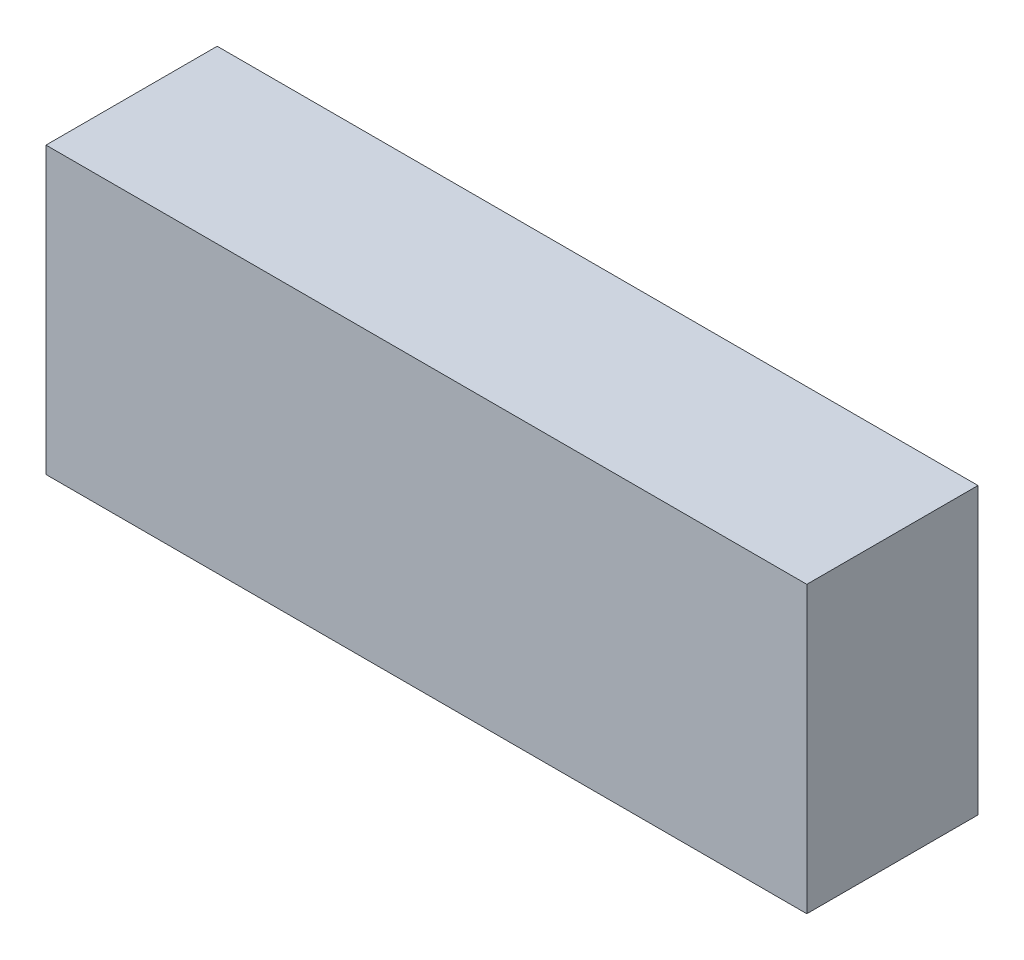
ISO-10303-21;
HEADER;
FILE_DESCRIPTION(('STEP AP214'),'2;1');
FILE_NAME('part.step','',(''),(''),'','','');
FILE_SCHEMA(('AUTOMOTIVE_DESIGN { 1 0 10303 214 1 1 1 1 }'));
ENDSEC;
DATA;
#1=APPLICATION_CONTEXT('core data for automotive mechanical design processes');
#2=APPLICATION_PROTOCOL_DEFINITION('international standard','automotive_design',2000,#1);
#3=PRODUCT_CONTEXT('',#1,'mechanical');
#4=PRODUCT('Part','Part','',(#3));
#5=PRODUCT_RELATED_PRODUCT_CATEGORY('part','',(#4));
#6=PRODUCT_DEFINITION_FORMATION('','',#4);
#7=PRODUCT_DEFINITION_CONTEXT('part definition',#1,'design');
#8=PRODUCT_DEFINITION('design','',#6,#7);
#9=PRODUCT_DEFINITION_SHAPE('','',#8);
#10=(LENGTH_UNIT() NAMED_UNIT(*) SI_UNIT(.MILLI.,.METRE.));
#11=(NAMED_UNIT(*) PLANE_ANGLE_UNIT() SI_UNIT($,.RADIAN.));
#12=(NAMED_UNIT(*) SI_UNIT($,.STERADIAN.) SOLID_ANGLE_UNIT());
#13=UNCERTAINTY_MEASURE_WITH_UNIT(LENGTH_MEASURE(1.E-05),#10,'distance_accuracy_value','');
#14=(GEOMETRIC_REPRESENTATION_CONTEXT(3) GLOBAL_UNCERTAINTY_ASSIGNED_CONTEXT((#13)) GLOBAL_UNIT_ASSIGNED_CONTEXT((#10,
#11,#12)) REPRESENTATION_CONTEXT('',''));
#15=CARTESIAN_POINT('',(0.,0.,0.));
#16=DIRECTION('',(0.,0.,1.));
#17=DIRECTION('',(1.,0.,0.));
#18=AXIS2_PLACEMENT_3D('',#15,#16,#17);
#19=CARTESIAN_POINT('',(103.757714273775,-108.74585015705,180.));
#20=DIRECTION('',(1.,0.,0.));
#21=DIRECTION('',(0.,1.,0.));
#22=AXIS2_PLACEMENT_3D('',#19,#20,#21);
#23=PLANE('',#22);
#24=DIRECTION('',(0.,-1.,0.));
#25=VECTOR('',#24,1.);
#26=CARTESIAN_POINT('',(103.757714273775,-108.74585015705,0.));
#27=LINE('',#26,#25);
#28=CARTESIAN_POINT('',(103.757714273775,-108.74585015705,0.));
#29=VERTEX_POINT('',#28);
#30=CARTESIAN_POINT('',(103.757714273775,-408.74585015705,0.));
#31=VERTEX_POINT('',#30);
#32=EDGE_CURVE('E98',#29,#31,#27,.T.);
#33=ORIENTED_EDGE('',*,*,#32,.T.);
#34=DIRECTION('',(0.,0.,-1.));
#35=VECTOR('',#34,1.);
#36=CARTESIAN_POINT('',(103.757714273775,-408.74585015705,180.));
#37=LINE('',#36,#35);
#38=CARTESIAN_POINT('',(103.757714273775,-408.74585015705,180.));
#39=VERTEX_POINT('',#38);
#40=EDGE_CURVE('E11',#39,#31,#37,.T.);
#41=ORIENTED_EDGE('',*,*,#40,.F.);
#42=DIRECTION('',(0.,-1.,0.));
#43=VECTOR('',#42,1.);
#44=CARTESIAN_POINT('',(103.757714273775,-108.74585015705,180.));
#45=LINE('',#44,#43);
#46=CARTESIAN_POINT('',(103.757714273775,-108.74585015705,180.));
#47=VERTEX_POINT('',#46);
#48=EDGE_CURVE('E86',#47,#39,#45,.T.);
#49=ORIENTED_EDGE('',*,*,#48,.F.);
#50=DIRECTION('',(0.,0.,-1.));
#51=VECTOR('',#50,1.);
#52=CARTESIAN_POINT('',(103.757714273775,-108.74585015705,180.));
#53=LINE('',#52,#51);
#54=EDGE_CURVE('E94',#47,#29,#53,.T.);
#55=ORIENTED_EDGE('',*,*,#54,.T.);
#56=EDGE_LOOP('',(#33,#41,#49,#55));
#57=FACE_BOUND('',#56,.T.);
#58=ADVANCED_FACE('F35',(#57),#23,.F.);
#59=CARTESIAN_POINT('',(103.757714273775,-408.74585015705,180.));
#60=DIRECTION('',(0.,1.,0.));
#61=DIRECTION('',(0.,0.,1.));
#62=AXIS2_PLACEMENT_3D('',#59,#60,#61);
#63=PLANE('',#62);
#64=DIRECTION('',(1.,0.,0.));
#65=VECTOR('',#64,1.);
#66=CARTESIAN_POINT('',(103.757714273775,-408.74585015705,0.));
#67=LINE('',#66,#65);
#68=CARTESIAN_POINT('',(903.757714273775,-408.74585015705,0.));
#69=VERTEX_POINT('',#68);
#70=EDGE_CURVE('E90',#31,#69,#67,.T.);
#71=ORIENTED_EDGE('',*,*,#70,.T.);
#72=DIRECTION('',(0.,0.,-1.));
#73=VECTOR('',#72,1.);
#74=CARTESIAN_POINT('',(903.757714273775,-408.74585015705,180.));
#75=LINE('',#74,#73);
#76=CARTESIAN_POINT('',(903.757714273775,-408.74585015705,180.));
#77=VERTEX_POINT('',#76);
#78=EDGE_CURVE('E43',#77,#69,#75,.T.);
#79=ORIENTED_EDGE('',*,*,#78,.F.);
#80=DIRECTION('',(1.,0.,0.));
#81=VECTOR('',#80,1.);
#82=CARTESIAN_POINT('',(103.757714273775,-408.74585015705,180.));
#83=LINE('',#82,#81);
#84=EDGE_CURVE('E81',#39,#77,#83,.T.);
#85=ORIENTED_EDGE('',*,*,#84,.F.);
#86=ORIENTED_EDGE('',*,*,#40,.T.);
#87=EDGE_LOOP('',(#71,#79,#85,#86));
#88=FACE_BOUND('',#87,.T.);
#89=ADVANCED_FACE('F89',(#88),#63,.F.);
#90=CARTESIAN_POINT('',(903.757714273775,-108.74585015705,180.));
#91=DIRECTION('',(-1.,0.,0.));
#92=DIRECTION('',(0.,0.,1.));
#93=AXIS2_PLACEMENT_3D('',#90,#91,#92);
#94=PLANE('',#93);
#95=DIRECTION('',(0.,1.,0.));
#96=VECTOR('',#95,1.);
#97=CARTESIAN_POINT('',(903.757714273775,-108.74585015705,0.));
#98=LINE('',#97,#96);
#99=CARTESIAN_POINT('',(903.757714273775,-108.74585015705,0.));
#100=VERTEX_POINT('',#99);
#101=EDGE_CURVE('E68',#69,#100,#98,.T.);
#102=ORIENTED_EDGE('',*,*,#101,.T.);
#103=DIRECTION('',(0.,0.,-1.));
#104=VECTOR('',#103,1.);
#105=CARTESIAN_POINT('',(903.757714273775,-108.74585015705,180.));
#106=LINE('',#105,#104);
#107=CARTESIAN_POINT('',(903.757714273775,-108.74585015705,180.));
#108=VERTEX_POINT('',#107);
#109=EDGE_CURVE('E91',#108,#100,#106,.T.);
#110=ORIENTED_EDGE('',*,*,#109,.F.);
#111=DIRECTION('',(0.,1.,0.));
#112=VECTOR('',#111,1.);
#113=CARTESIAN_POINT('',(903.757714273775,-108.74585015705,180.));
#114=LINE('',#113,#112);
#115=EDGE_CURVE('E84',#77,#108,#114,.T.);
#116=ORIENTED_EDGE('',*,*,#115,.F.);
#117=ORIENTED_EDGE('',*,*,#78,.T.);
#118=EDGE_LOOP('',(#102,#110,#116,#117));
#119=FACE_BOUND('',#118,.T.);
#120=ADVANCED_FACE('F92',(#119),#94,.F.);
#121=CARTESIAN_POINT('',(103.757714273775,-108.74585015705,180.));
#122=DIRECTION('',(0.,-1.,0.));
#123=DIRECTION('',(0.,0.,-1.));
#124=AXIS2_PLACEMENT_3D('',#121,#122,#123);
#125=PLANE('',#124);
#126=DIRECTION('',(-1.,0.,0.));
#127=VECTOR('',#126,1.);
#128=CARTESIAN_POINT('',(103.757714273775,-108.74585015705,0.));
#129=LINE('',#128,#127);
#130=EDGE_CURVE('E74',#100,#29,#129,.T.);
#131=ORIENTED_EDGE('',*,*,#130,.T.);
#132=ORIENTED_EDGE('',*,*,#54,.F.);
#133=DIRECTION('',(-1.,0.,0.));
#134=VECTOR('',#133,1.);
#135=CARTESIAN_POINT('',(103.757714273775,-108.74585015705,180.));
#136=LINE('',#135,#134);
#137=EDGE_CURVE('E51',#108,#47,#136,.T.);
#138=ORIENTED_EDGE('',*,*,#137,.F.);
#139=ORIENTED_EDGE('',*,*,#109,.T.);
#140=EDGE_LOOP('',(#131,#132,#138,#139));
#141=FACE_BOUND('',#140,.T.);
#142=ADVANCED_FACE('F105',(#141),#125,.F.);
#143=CARTESIAN_POINT('',(0.,0.,180.));
#144=DIRECTION('',(0.,0.,1.));
#145=DIRECTION('',(1.,0.,0.));
#146=AXIS2_PLACEMENT_3D('',#143,#144,#145);
#147=PLANE('',#146);
#148=ORIENTED_EDGE('',*,*,#48,.T.);
#149=ORIENTED_EDGE('',*,*,#84,.T.);
#150=ORIENTED_EDGE('',*,*,#115,.T.);
#151=ORIENTED_EDGE('',*,*,#137,.T.);
#152=EDGE_LOOP('',(#148,#149,#150,#151));
#153=FACE_BOUND('',#152,.T.);
#154=ADVANCED_FACE('F82',(#153),#147,.T.);
#155=CARTESIAN_POINT('',(0.,0.,0.));
#156=DIRECTION('',(0.,0.,1.));
#157=DIRECTION('',(1.,0.,0.));
#158=AXIS2_PLACEMENT_3D('',#155,#156,#157);
#159=PLANE('',#158);
#160=ORIENTED_EDGE('',*,*,#32,.F.);
#161=ORIENTED_EDGE('',*,*,#130,.F.);
#162=ORIENTED_EDGE('',*,*,#101,.F.);
#163=ORIENTED_EDGE('',*,*,#70,.F.);
#164=EDGE_LOOP('',(#160,#161,#162,#163));
#165=FACE_BOUND('',#164,.T.);
#166=ADVANCED_FACE('F108',(#165),#159,.F.);
#167=CLOSED_SHELL('',(#58,#89,#120,#142,#154,#166));
#168=MANIFOLD_SOLID_BREP('B2',#167);
#169=ADVANCED_BREP_SHAPE_REPRESENTATION('',(#18,#168),#14);
#170=SHAPE_DEFINITION_REPRESENTATION(#9,#169);
ENDSEC;
END-ISO-10303-21;
